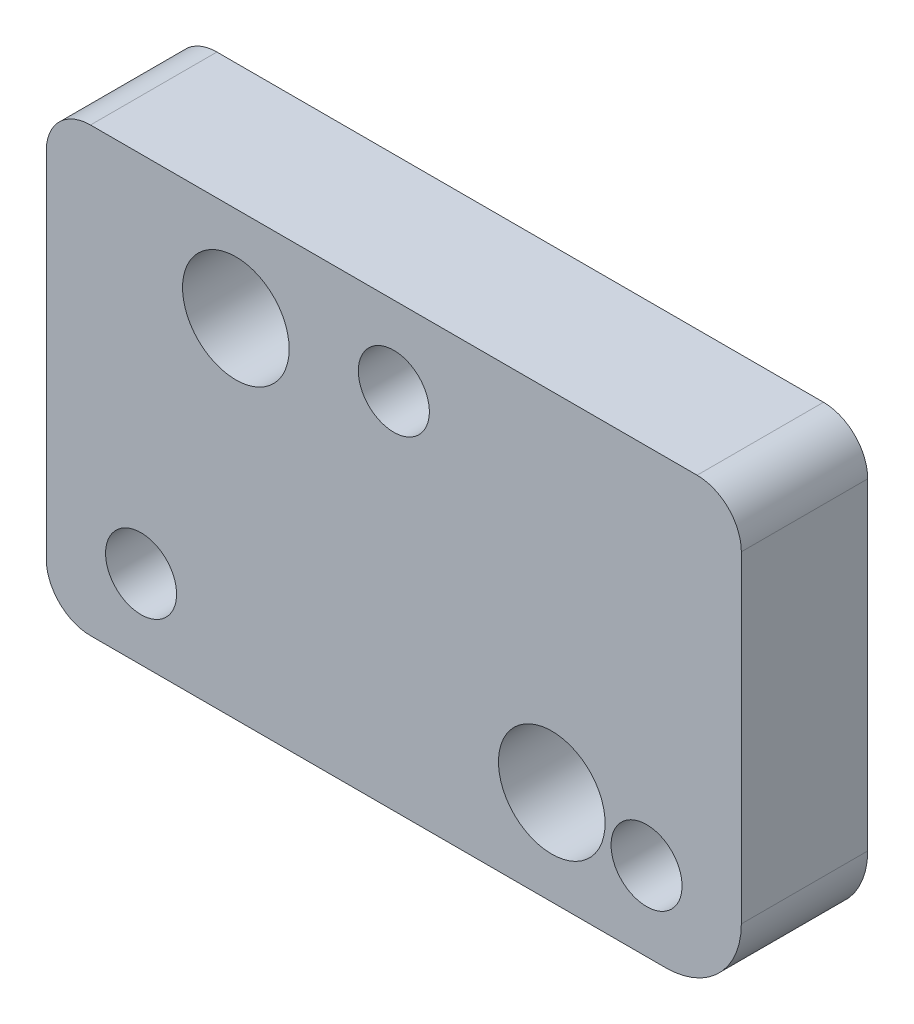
ISO-10303-21;
HEADER;
FILE_DESCRIPTION(('STEP AP214'),'2;1');
FILE_NAME('part.step','',(''),(''),'','','');
FILE_SCHEMA(('AUTOMOTIVE_DESIGN { 1 0 10303 214 1 1 1 1 }'));
ENDSEC;
DATA;
#1=APPLICATION_CONTEXT('core data for automotive mechanical design processes');
#2=APPLICATION_PROTOCOL_DEFINITION('international standard','automotive_design',2000,#1);
#3=PRODUCT_CONTEXT('',#1,'mechanical');
#4=PRODUCT('Part','Part','',(#3));
#5=PRODUCT_RELATED_PRODUCT_CATEGORY('part','',(#4));
#6=PRODUCT_DEFINITION_FORMATION('','',#4);
#7=PRODUCT_DEFINITION_CONTEXT('part definition',#1,'design');
#8=PRODUCT_DEFINITION('design','',#6,#7);
#9=PRODUCT_DEFINITION_SHAPE('','',#8);
#10=(LENGTH_UNIT() NAMED_UNIT(*) SI_UNIT(.MILLI.,.METRE.));
#11=(NAMED_UNIT(*) PLANE_ANGLE_UNIT() SI_UNIT($,.RADIAN.));
#12=(NAMED_UNIT(*) SI_UNIT($,.STERADIAN.) SOLID_ANGLE_UNIT());
#13=UNCERTAINTY_MEASURE_WITH_UNIT(LENGTH_MEASURE(1.E-05),#10,'distance_accuracy_value','');
#14=(GEOMETRIC_REPRESENTATION_CONTEXT(3) GLOBAL_UNCERTAINTY_ASSIGNED_CONTEXT((#13)) GLOBAL_UNIT_ASSIGNED_CONTEXT((#10,
#11,#12)) REPRESENTATION_CONTEXT('',''));
#15=CARTESIAN_POINT('',(0.,0.,0.));
#16=DIRECTION('',(0.,0.,1.));
#17=DIRECTION('',(1.,0.,0.));
#18=AXIS2_PLACEMENT_3D('',#15,#16,#17);
#19=CARTESIAN_POINT('',(-840.26329577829,-45.5554062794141,84.6582));
#20=DIRECTION('',(0.,0.,-1.));
#21=DIRECTION('',(-1.,0.,0.));
#22=AXIS2_PLACEMENT_3D('',#19,#20,#21);
#23=CYLINDRICAL_SURFACE('',#22,7.61999999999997);
#24=CARTESIAN_POINT('',(-840.26329577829,-45.5554062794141,71.9582));
#25=DIRECTION('',(0.,0.,-1.));
#26=DIRECTION('',(-1.,0.,0.));
#27=AXIS2_PLACEMENT_3D('',#24,#25,#26);
#28=CIRCLE('',#27,7.61999999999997);
#29=CARTESIAN_POINT('',(-832.64329577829,-45.5554062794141,71.9582));
#30=VERTEX_POINT('',#29);
#31=CARTESIAN_POINT('',(-840.26329577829,-53.1754062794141,71.9582));
#32=VERTEX_POINT('',#31);
#33=EDGE_CURVE('E153',#30,#32,#28,.T.);
#34=ORIENTED_EDGE('',*,*,#33,.F.);
#35=DIRECTION('',(0.,0.,-1.));
#36=VECTOR('',#35,1.);
#37=CARTESIAN_POINT('',(-832.64329577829,-45.5554062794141,84.6582));
#38=LINE('',#37,#36);
#39=CARTESIAN_POINT('',(-832.64329577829,-45.5554062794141,84.6582));
#40=VERTEX_POINT('',#39);
#41=EDGE_CURVE('E11',#40,#30,#38,.T.);
#42=ORIENTED_EDGE('',*,*,#41,.F.);
#43=CARTESIAN_POINT('',(-840.26329577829,-45.5554062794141,84.6582));
#44=DIRECTION('',(0.,0.,-1.));
#45=DIRECTION('',(-1.,0.,0.));
#46=AXIS2_PLACEMENT_3D('',#43,#44,#45);
#47=CIRCLE('',#46,7.61999999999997);
#48=CARTESIAN_POINT('',(-840.26329577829,-53.1754062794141,84.6582));
#49=VERTEX_POINT('',#48);
#50=EDGE_CURVE('E182',#40,#49,#47,.T.);
#51=ORIENTED_EDGE('',*,*,#50,.T.);
#52=DIRECTION('',(0.,0.,-1.));
#53=VECTOR('',#52,1.);
#54=CARTESIAN_POINT('',(-840.26329577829,-53.1754062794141,84.6582));
#55=LINE('',#54,#53);
#56=EDGE_CURVE('E52',#49,#32,#55,.T.);
#57=ORIENTED_EDGE('',*,*,#56,.T.);
#58=EDGE_LOOP('',(#34,#42,#51,#57));
#59=FACE_BOUND('',#58,.T.);
#60=ADVANCED_FACE('F49',(#59),#23,.T.);
#61=CARTESIAN_POINT('',(-832.64329577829,-13.1704062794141,84.6582));
#62=DIRECTION('',(1.,0.,0.));
#63=DIRECTION('',(0.,0.,-1.));
#64=AXIS2_PLACEMENT_3D('',#61,#62,#63);
#65=PLANE('',#64);
#66=DIRECTION('',(0.,-1.,0.));
#67=VECTOR('',#66,1.);
#68=CARTESIAN_POINT('',(-832.64329577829,-13.1704062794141,71.9582));
#69=LINE('',#68,#67);
#70=CARTESIAN_POINT('',(-832.64329577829,-13.1704062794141,71.9582));
#71=VERTEX_POINT('',#70);
#72=EDGE_CURVE('E179',#71,#30,#69,.T.);
#73=ORIENTED_EDGE('',*,*,#72,.F.);
#74=DIRECTION('',(0.,0.,-1.));
#75=VECTOR('',#74,1.);
#76=CARTESIAN_POINT('',(-832.64329577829,-13.1704062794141,84.6582));
#77=LINE('',#76,#75);
#78=CARTESIAN_POINT('',(-832.64329577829,-13.1704062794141,84.6582));
#79=VERTEX_POINT('',#78);
#80=EDGE_CURVE('E59',#79,#71,#77,.T.);
#81=ORIENTED_EDGE('',*,*,#80,.F.);
#82=DIRECTION('',(0.,-1.,0.));
#83=VECTOR('',#82,1.);
#84=CARTESIAN_POINT('',(-832.64329577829,-13.1704062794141,84.6582));
#85=LINE('',#84,#83);
#86=EDGE_CURVE('E138',#79,#40,#85,.T.);
#87=ORIENTED_EDGE('',*,*,#86,.T.);
#88=ORIENTED_EDGE('',*,*,#41,.T.);
#89=EDGE_LOOP('',(#73,#81,#87,#88));
#90=FACE_BOUND('',#89,.T.);
#91=ADVANCED_FACE('F202',(#90),#65,.T.);
#92=CARTESIAN_POINT('',(-837.08829577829,-13.1704062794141,84.6582));
#93=DIRECTION('',(0.,0.,-1.));
#94=DIRECTION('',(-1.,0.,0.));
#95=AXIS2_PLACEMENT_3D('',#92,#93,#94);
#96=CYLINDRICAL_SURFACE('',#95,4.44500000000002);
#97=CARTESIAN_POINT('',(-837.08829577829,-13.1704062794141,71.9582));
#98=DIRECTION('',(0.,0.,-1.));
#99=DIRECTION('',(-1.,0.,0.));
#100=AXIS2_PLACEMENT_3D('',#97,#98,#99);
#101=CIRCLE('',#100,4.44500000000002);
#102=CARTESIAN_POINT('',(-837.08829577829,-8.72540627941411,71.9582));
#103=VERTEX_POINT('',#102);
#104=EDGE_CURVE('E124',#103,#71,#101,.T.);
#105=ORIENTED_EDGE('',*,*,#104,.F.);
#106=DIRECTION('',(0.,0.,-1.));
#107=VECTOR('',#106,1.);
#108=CARTESIAN_POINT('',(-837.08829577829,-8.72540627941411,84.6582));
#109=LINE('',#108,#107);
#110=CARTESIAN_POINT('',(-837.08829577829,-8.72540627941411,84.6582));
#111=VERTEX_POINT('',#110);
#112=EDGE_CURVE('E119',#111,#103,#109,.T.);
#113=ORIENTED_EDGE('',*,*,#112,.F.);
#114=CARTESIAN_POINT('',(-837.08829577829,-13.1704062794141,84.6582));
#115=DIRECTION('',(0.,0.,-1.));
#116=DIRECTION('',(-1.,0.,0.));
#117=AXIS2_PLACEMENT_3D('',#114,#115,#116);
#118=CIRCLE('',#117,4.44500000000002);
#119=EDGE_CURVE('E122',#111,#79,#118,.T.);
#120=ORIENTED_EDGE('',*,*,#119,.T.);
#121=ORIENTED_EDGE('',*,*,#80,.T.);
#122=EDGE_LOOP('',(#105,#113,#120,#121));
#123=FACE_BOUND('',#122,.T.);
#124=ADVANCED_FACE('F121',(#123),#96,.T.);
#125=CARTESIAN_POINT('',(-898.04829577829,-8.72540627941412,84.6582));
#126=DIRECTION('',(0.,1.,0.));
#127=DIRECTION('',(0.,0.,1.));
#128=AXIS2_PLACEMENT_3D('',#125,#126,#127);
#129=PLANE('',#128);
#130=DIRECTION('',(1.,0.,0.));
#131=VECTOR('',#130,1.);
#132=CARTESIAN_POINT('',(-898.04829577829,-8.72540627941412,71.9582));
#133=LINE('',#132,#131);
#134=CARTESIAN_POINT('',(-898.04829577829,-8.72540627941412,71.9582));
#135=VERTEX_POINT('',#134);
#136=EDGE_CURVE('E174',#135,#103,#133,.T.);
#137=ORIENTED_EDGE('',*,*,#136,.F.);
#138=DIRECTION('',(0.,0.,-1.));
#139=VECTOR('',#138,1.);
#140=CARTESIAN_POINT('',(-898.04829577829,-8.72540627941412,84.6582));
#141=LINE('',#140,#139);
#142=CARTESIAN_POINT('',(-898.04829577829,-8.72540627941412,84.6582));
#143=VERTEX_POINT('',#142);
#144=EDGE_CURVE('E130',#143,#135,#141,.T.);
#145=ORIENTED_EDGE('',*,*,#144,.F.);
#146=DIRECTION('',(1.,0.,0.));
#147=VECTOR('',#146,1.);
#148=CARTESIAN_POINT('',(-898.04829577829,-8.72540627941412,84.6582));
#149=LINE('',#148,#147);
#150=EDGE_CURVE('E136',#143,#111,#149,.T.);
#151=ORIENTED_EDGE('',*,*,#150,.T.);
#152=ORIENTED_EDGE('',*,*,#112,.T.);
#153=EDGE_LOOP('',(#137,#145,#151,#152));
#154=FACE_BOUND('',#153,.T.);
#155=ADVANCED_FACE('F141',(#154),#129,.T.);
#156=CARTESIAN_POINT('',(-898.04829577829,-13.1704062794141,84.6582));
#157=DIRECTION('',(0.,0.,-1.));
#158=DIRECTION('',(-1.,0.,0.));
#159=AXIS2_PLACEMENT_3D('',#156,#157,#158);
#160=CYLINDRICAL_SURFACE('',#159,4.44500000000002);
#161=CARTESIAN_POINT('',(-898.04829577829,-13.1704062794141,71.9582));
#162=DIRECTION('',(0.,0.,-1.));
#163=DIRECTION('',(-1.,0.,0.));
#164=AXIS2_PLACEMENT_3D('',#161,#162,#163);
#165=CIRCLE('',#164,4.44500000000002);
#166=CARTESIAN_POINT('',(-902.49329577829,-13.1704062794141,71.9582));
#167=VERTEX_POINT('',#166);
#168=EDGE_CURVE('E170',#167,#135,#165,.T.);
#169=ORIENTED_EDGE('',*,*,#168,.F.);
#170=DIRECTION('',(0.,0.,-1.));
#171=VECTOR('',#170,1.);
#172=CARTESIAN_POINT('',(-902.49329577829,-13.1704062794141,84.6582));
#173=LINE('',#172,#171);
#174=CARTESIAN_POINT('',(-902.49329577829,-13.1704062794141,84.6582));
#175=VERTEX_POINT('',#174);
#176=EDGE_CURVE('E188',#175,#167,#173,.T.);
#177=ORIENTED_EDGE('',*,*,#176,.F.);
#178=CARTESIAN_POINT('',(-898.04829577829,-13.1704062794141,84.6582));
#179=DIRECTION('',(0.,0.,-1.));
#180=DIRECTION('',(-1.,0.,0.));
#181=AXIS2_PLACEMENT_3D('',#178,#179,#180);
#182=CIRCLE('',#181,4.44500000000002);
#183=EDGE_CURVE('E143',#175,#143,#182,.T.);
#184=ORIENTED_EDGE('',*,*,#183,.T.);
#185=ORIENTED_EDGE('',*,*,#144,.T.);
#186=EDGE_LOOP('',(#169,#177,#184,#185));
#187=FACE_BOUND('',#186,.T.);
#188=ADVANCED_FACE('F215',(#187),#160,.T.);
#189=CARTESIAN_POINT('',(-902.49329577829,-48.7304062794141,84.6582));
#190=DIRECTION('',(-1.,0.,0.));
#191=DIRECTION('',(0.,0.,1.));
#192=AXIS2_PLACEMENT_3D('',#189,#190,#191);
#193=PLANE('',#192);
#194=DIRECTION('',(0.,1.,0.));
#195=VECTOR('',#194,1.);
#196=CARTESIAN_POINT('',(-902.49329577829,-48.7304062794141,71.9582));
#197=LINE('',#196,#195);
#198=CARTESIAN_POINT('',(-902.49329577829,-48.7304062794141,71.9582));
#199=VERTEX_POINT('',#198);
#200=EDGE_CURVE('E166',#199,#167,#197,.T.);
#201=ORIENTED_EDGE('',*,*,#200,.F.);
#202=DIRECTION('',(0.,0.,-1.));
#203=VECTOR('',#202,1.);
#204=CARTESIAN_POINT('',(-902.49329577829,-48.7304062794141,84.6582));
#205=LINE('',#204,#203);
#206=CARTESIAN_POINT('',(-902.49329577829,-48.7304062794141,84.6582));
#207=VERTEX_POINT('',#206);
#208=EDGE_CURVE('E191',#207,#199,#205,.T.);
#209=ORIENTED_EDGE('',*,*,#208,.F.);
#210=DIRECTION('',(0.,1.,0.));
#211=VECTOR('',#210,1.);
#212=CARTESIAN_POINT('',(-902.49329577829,-48.7304062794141,84.6582));
#213=LINE('',#212,#211);
#214=EDGE_CURVE('E147',#207,#175,#213,.T.);
#215=ORIENTED_EDGE('',*,*,#214,.T.);
#216=ORIENTED_EDGE('',*,*,#176,.T.);
#217=EDGE_LOOP('',(#201,#209,#215,#216));
#218=FACE_BOUND('',#217,.T.);
#219=ADVANCED_FACE('F218',(#218),#193,.T.);
#220=CARTESIAN_POINT('',(-898.04829577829,-48.7304062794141,84.6582));
#221=DIRECTION('',(0.,0.,-1.));
#222=DIRECTION('',(-1.,0.,0.));
#223=AXIS2_PLACEMENT_3D('',#220,#221,#222);
#224=CYLINDRICAL_SURFACE('',#223,4.44500000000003);
#225=CARTESIAN_POINT('',(-898.04829577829,-48.7304062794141,71.9582));
#226=DIRECTION('',(0.,0.,-1.));
#227=DIRECTION('',(-1.,0.,0.));
#228=AXIS2_PLACEMENT_3D('',#225,#226,#227);
#229=CIRCLE('',#228,4.44500000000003);
#230=CARTESIAN_POINT('',(-898.04829577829,-53.1754062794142,71.9582));
#231=VERTEX_POINT('',#230);
#232=EDGE_CURVE('E162',#231,#199,#229,.T.);
#233=ORIENTED_EDGE('',*,*,#232,.F.);
#234=DIRECTION('',(0.,0.,-1.));
#235=VECTOR('',#234,1.);
#236=CARTESIAN_POINT('',(-898.04829577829,-53.1754062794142,84.6582));
#237=LINE('',#236,#235);
#238=CARTESIAN_POINT('',(-898.04829577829,-53.1754062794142,84.6582));
#239=VERTEX_POINT('',#238);
#240=EDGE_CURVE('E193',#239,#231,#237,.T.);
#241=ORIENTED_EDGE('',*,*,#240,.F.);
#242=CARTESIAN_POINT('',(-898.04829577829,-48.7304062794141,84.6582));
#243=DIRECTION('',(0.,0.,-1.));
#244=DIRECTION('',(-1.,0.,0.));
#245=AXIS2_PLACEMENT_3D('',#242,#243,#244);
#246=CIRCLE('',#245,4.44500000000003);
#247=EDGE_CURVE('E342',#239,#207,#246,.T.);
#248=ORIENTED_EDGE('',*,*,#247,.T.);
#249=ORIENTED_EDGE('',*,*,#208,.T.);
#250=EDGE_LOOP('',(#233,#241,#248,#249));
#251=FACE_BOUND('',#250,.T.);
#252=ADVANCED_FACE('F222',(#251),#224,.T.);
#253=CARTESIAN_POINT('',(-840.26329577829,-53.1754062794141,84.6582));
#254=DIRECTION('',(0.,-1.,0.));
#255=DIRECTION('',(1.,0.,0.));
#256=AXIS2_PLACEMENT_3D('',#253,#254,#255);
#257=PLANE('',#256);
#258=DIRECTION('',(-1.,0.,0.));
#259=VECTOR('',#258,1.);
#260=CARTESIAN_POINT('',(-840.26329577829,-53.1754062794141,71.9582));
#261=LINE('',#260,#259);
#262=EDGE_CURVE('E157',#32,#231,#261,.T.);
#263=ORIENTED_EDGE('',*,*,#262,.F.);
#264=ORIENTED_EDGE('',*,*,#56,.F.);
#265=DIRECTION('',(-1.,0.,0.));
#266=VECTOR('',#265,1.);
#267=CARTESIAN_POINT('',(-840.26329577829,-53.1754062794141,84.6582));
#268=LINE('',#267,#266);
#269=EDGE_CURVE('E339',#49,#239,#268,.T.);
#270=ORIENTED_EDGE('',*,*,#269,.T.);
#271=ORIENTED_EDGE('',*,*,#240,.T.);
#272=EDGE_LOOP('',(#263,#264,#270,#271));
#273=FACE_BOUND('',#272,.T.);
#274=ADVANCED_FACE('F199',(#273),#257,.T.);
#275=CARTESIAN_POINT('',(-840.26329577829,-45.5554062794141,84.6582));
#276=DIRECTION('',(0.,0.,-1.));
#277=DIRECTION('',(-1.,0.,0.));
#278=AXIS2_PLACEMENT_3D('',#275,#276,#277);
#279=PLANE('',#278);
#280=CARTESIAN_POINT('',(-851.69329577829,-43.6504062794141,84.6582));
#281=DIRECTION('',(0.,0.,1.));
#282=DIRECTION('',(1.,0.,0.));
#283=AXIS2_PLACEMENT_3D('',#280,#281,#282);
#284=CIRCLE('',#283,5.35940000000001);
#285=CARTESIAN_POINT('',(-846.33389577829,-43.6504062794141,84.6582));
#286=VERTEX_POINT('',#285);
#287=EDGE_CURVE('E291',#286,#286,#284,.T.);
#288=ORIENTED_EDGE('',*,*,#287,.F.);
#289=EDGE_LOOP('',(#288));
#290=FACE_BOUND('',#289,.T.);
#291=CARTESIAN_POINT('',(-883.44329577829,-18.2504062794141,84.6582));
#292=DIRECTION('',(0.,0.,1.));
#293=DIRECTION('',(1.,0.,0.));
#294=AXIS2_PLACEMENT_3D('',#291,#292,#293);
#295=CIRCLE('',#294,5.35940000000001);
#296=CARTESIAN_POINT('',(-878.08389577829,-18.2504062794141,84.6582));
#297=VERTEX_POINT('',#296);
#298=EDGE_CURVE('E310',#297,#297,#295,.T.);
#299=ORIENTED_EDGE('',*,*,#298,.F.);
#300=EDGE_LOOP('',(#299));
#301=FACE_BOUND('',#300,.T.);
#302=CARTESIAN_POINT('',(-842.16829577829,-45.2379062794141,84.6582));
#303=DIRECTION('',(0.,0.,-1.));
#304=DIRECTION('',(-1.,0.,0.));
#305=AXIS2_PLACEMENT_3D('',#302,#303,#304);
#306=CIRCLE('',#305,3.56869999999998);
#307=CARTESIAN_POINT('',(-845.73699577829,-45.2379062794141,84.6582));
#308=VERTEX_POINT('',#307);
#309=EDGE_CURVE('E314',#308,#308,#306,.T.);
#310=ORIENTED_EDGE('',*,*,#309,.T.);
#311=EDGE_LOOP('',(#310));
#312=FACE_BOUND('',#311,.T.);
#313=CARTESIAN_POINT('',(-892.96829577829,-45.2379062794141,84.6582));
#314=DIRECTION('',(0.,0.,-1.));
#315=DIRECTION('',(-1.,0.,0.));
#316=AXIS2_PLACEMENT_3D('',#313,#314,#315);
#317=CIRCLE('',#316,3.56869999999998);
#318=CARTESIAN_POINT('',(-896.53699577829,-45.2379062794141,84.6582));
#319=VERTEX_POINT('',#318);
#320=EDGE_CURVE('E322',#319,#319,#317,.T.);
#321=ORIENTED_EDGE('',*,*,#320,.T.);
#322=EDGE_LOOP('',(#321));
#323=FACE_BOUND('',#322,.T.);
#324=CARTESIAN_POINT('',(-867.56829577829,-16.6629062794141,84.6582));
#325=DIRECTION('',(0.,0.,-1.));
#326=DIRECTION('',(-1.,0.,0.));
#327=AXIS2_PLACEMENT_3D('',#324,#325,#326);
#328=CIRCLE('',#327,3.56869999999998);
#329=CARTESIAN_POINT('',(-871.13699577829,-16.6629062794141,84.6582));
#330=VERTEX_POINT('',#329);
#331=EDGE_CURVE('E330',#330,#330,#328,.T.);
#332=ORIENTED_EDGE('',*,*,#331,.T.);
#333=EDGE_LOOP('',(#332));
#334=FACE_BOUND('',#333,.T.);
#335=ORIENTED_EDGE('',*,*,#50,.F.);
#336=ORIENTED_EDGE('',*,*,#86,.F.);
#337=ORIENTED_EDGE('',*,*,#119,.F.);
#338=ORIENTED_EDGE('',*,*,#150,.F.);
#339=ORIENTED_EDGE('',*,*,#183,.F.);
#340=ORIENTED_EDGE('',*,*,#214,.F.);
#341=ORIENTED_EDGE('',*,*,#247,.F.);
#342=ORIENTED_EDGE('',*,*,#269,.F.);
#343=EDGE_LOOP('',(#335,#336,#337,#338,#339,#340,#341,#342));
#344=FACE_BOUND('',#343,.T.);
#345=ADVANCED_FACE('F134',(#290,#301,#312,#323,#334,#344),#279,.F.);
#346=CARTESIAN_POINT('',(-840.26329577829,-45.5554062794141,71.9582));
#347=DIRECTION('',(0.,0.,-1.));
#348=DIRECTION('',(-1.,0.,0.));
#349=AXIS2_PLACEMENT_3D('',#346,#347,#348);
#350=PLANE('',#349);
#351=CARTESIAN_POINT('',(-851.69329577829,-43.6504062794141,71.9582));
#352=DIRECTION('',(0.,0.,1.));
#353=DIRECTION('',(1.,0.,0.));
#354=AXIS2_PLACEMENT_3D('',#351,#352,#353);
#355=CIRCLE('',#354,3.56869999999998);
#356=CARTESIAN_POINT('',(-848.12459577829,-43.6504062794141,71.9582));
#357=VERTEX_POINT('',#356);
#358=EDGE_CURVE('E280',#357,#357,#355,.T.);
#359=ORIENTED_EDGE('',*,*,#358,.T.);
#360=EDGE_LOOP('',(#359));
#361=FACE_BOUND('',#360,.T.);
#362=CARTESIAN_POINT('',(-883.44329577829,-18.2504062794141,71.9582));
#363=DIRECTION('',(0.,0.,1.));
#364=DIRECTION('',(1.,0.,0.));
#365=AXIS2_PLACEMENT_3D('',#362,#363,#364);
#366=CIRCLE('',#365,3.56869999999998);
#367=CARTESIAN_POINT('',(-879.87459577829,-18.2504062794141,71.9582));
#368=VERTEX_POINT('',#367);
#369=EDGE_CURVE('E298',#368,#368,#366,.T.);
#370=ORIENTED_EDGE('',*,*,#369,.T.);
#371=EDGE_LOOP('',(#370));
#372=FACE_BOUND('',#371,.T.);
#373=CARTESIAN_POINT('',(-842.16829577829,-45.2379062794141,71.9582));
#374=DIRECTION('',(0.,0.,-1.));
#375=DIRECTION('',(-1.,0.,0.));
#376=AXIS2_PLACEMENT_3D('',#373,#374,#375);
#377=CIRCLE('',#376,3.56869999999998);
#378=CARTESIAN_POINT('',(-845.73699577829,-45.2379062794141,71.9582));
#379=VERTEX_POINT('',#378);
#380=EDGE_CURVE('E318',#379,#379,#377,.T.);
#381=ORIENTED_EDGE('',*,*,#380,.F.);
#382=EDGE_LOOP('',(#381));
#383=FACE_BOUND('',#382,.T.);
#384=CARTESIAN_POINT('',(-892.96829577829,-45.2379062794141,71.9582));
#385=DIRECTION('',(0.,0.,-1.));
#386=DIRECTION('',(-1.,0.,0.));
#387=AXIS2_PLACEMENT_3D('',#384,#385,#386);
#388=CIRCLE('',#387,3.56869999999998);
#389=CARTESIAN_POINT('',(-896.53699577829,-45.2379062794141,71.9582));
#390=VERTEX_POINT('',#389);
#391=EDGE_CURVE('E326',#390,#390,#388,.T.);
#392=ORIENTED_EDGE('',*,*,#391,.F.);
#393=EDGE_LOOP('',(#392));
#394=FACE_BOUND('',#393,.T.);
#395=CARTESIAN_POINT('',(-867.56829577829,-16.6629062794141,71.9582));
#396=DIRECTION('',(0.,0.,-1.));
#397=DIRECTION('',(-1.,0.,0.));
#398=AXIS2_PLACEMENT_3D('',#395,#396,#397);
#399=CIRCLE('',#398,3.56869999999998);
#400=CARTESIAN_POINT('',(-871.13699577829,-16.6629062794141,71.9582));
#401=VERTEX_POINT('',#400);
#402=EDGE_CURVE('E158',#401,#401,#399,.T.);
#403=ORIENTED_EDGE('',*,*,#402,.F.);
#404=EDGE_LOOP('',(#403));
#405=FACE_BOUND('',#404,.T.);
#406=ORIENTED_EDGE('',*,*,#33,.T.);
#407=ORIENTED_EDGE('',*,*,#262,.T.);
#408=ORIENTED_EDGE('',*,*,#232,.T.);
#409=ORIENTED_EDGE('',*,*,#200,.T.);
#410=ORIENTED_EDGE('',*,*,#168,.T.);
#411=ORIENTED_EDGE('',*,*,#136,.T.);
#412=ORIENTED_EDGE('',*,*,#104,.T.);
#413=ORIENTED_EDGE('',*,*,#72,.T.);
#414=EDGE_LOOP('',(#406,#407,#408,#409,#410,#411,#412,#413));
#415=FACE_BOUND('',#414,.T.);
#416=ADVANCED_FACE('F201',(#361,#372,#383,#394,#405,#415),#350,.T.);
#417=CARTESIAN_POINT('',(-867.56829577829,-16.6629062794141,71.9582));
#418=DIRECTION('',(0.,0.,-1.));
#419=DIRECTION('',(-1.,0.,0.));
#420=AXIS2_PLACEMENT_3D('',#417,#418,#419);
#421=CYLINDRICAL_SURFACE('',#420,3.56869999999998);
#422=ORIENTED_EDGE('',*,*,#331,.F.);
#423=EDGE_LOOP('',(#422));
#424=FACE_BOUND('',#423,.T.);
#425=ORIENTED_EDGE('',*,*,#402,.T.);
#426=EDGE_LOOP('',(#425));
#427=FACE_BOUND('',#426,.T.);
#428=ADVANCED_FACE('F236',(#424,#427),#421,.F.);
#429=CARTESIAN_POINT('',(-892.96829577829,-45.2379062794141,71.9582));
#430=DIRECTION('',(0.,0.,-1.));
#431=DIRECTION('',(-1.,0.,0.));
#432=AXIS2_PLACEMENT_3D('',#429,#430,#431);
#433=CYLINDRICAL_SURFACE('',#432,3.56869999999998);
#434=ORIENTED_EDGE('',*,*,#320,.F.);
#435=EDGE_LOOP('',(#434));
#436=FACE_BOUND('',#435,.T.);
#437=ORIENTED_EDGE('',*,*,#391,.T.);
#438=EDGE_LOOP('',(#437));
#439=FACE_BOUND('',#438,.T.);
#440=ADVANCED_FACE('F243',(#436,#439),#433,.F.);
#441=CARTESIAN_POINT('',(-842.16829577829,-45.2379062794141,71.9582));
#442=DIRECTION('',(0.,0.,-1.));
#443=DIRECTION('',(-1.,0.,0.));
#444=AXIS2_PLACEMENT_3D('',#441,#442,#443);
#445=CYLINDRICAL_SURFACE('',#444,3.56869999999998);
#446=ORIENTED_EDGE('',*,*,#309,.F.);
#447=EDGE_LOOP('',(#446));
#448=FACE_BOUND('',#447,.T.);
#449=ORIENTED_EDGE('',*,*,#380,.T.);
#450=EDGE_LOOP('',(#449));
#451=FACE_BOUND('',#450,.T.);
#452=ADVANCED_FACE('F247',(#448,#451),#445,.F.);
#453=CARTESIAN_POINT('',(-883.44329577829,-18.2504062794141,84.6582));
#454=DIRECTION('',(0.,0.,1.));
#455=DIRECTION('',(1.,0.,0.));
#456=AXIS2_PLACEMENT_3D('',#453,#454,#455);
#457=CYLINDRICAL_SURFACE('',#456,5.35940000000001);
#458=CARTESIAN_POINT('',(-883.44329577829,-18.2504062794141,76.7842));
#459=DIRECTION('',(0.,0.,1.));
#460=DIRECTION('',(1.,0.,0.));
#461=AXIS2_PLACEMENT_3D('',#458,#459,#460);
#462=CIRCLE('',#461,5.35940000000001);
#463=CARTESIAN_POINT('',(-878.08389577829,-18.2504062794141,76.7842));
#464=VERTEX_POINT('',#463);
#465=EDGE_CURVE('E306',#464,#464,#462,.T.);
#466=ORIENTED_EDGE('',*,*,#465,.F.);
#467=EDGE_LOOP('',(#466));
#468=FACE_BOUND('',#467,.T.);
#469=ORIENTED_EDGE('',*,*,#298,.T.);
#470=EDGE_LOOP('',(#469));
#471=FACE_BOUND('',#470,.T.);
#472=ADVANCED_FACE('F251',(#468,#471),#457,.F.);
#473=CARTESIAN_POINT('',(-879.87459577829,-18.2504062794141,76.7842));
#474=DIRECTION('',(0.,0.,-1.));
#475=DIRECTION('',(-1.,0.,0.));
#476=AXIS2_PLACEMENT_3D('',#473,#474,#475);
#477=PLANE('',#476);
#478=CARTESIAN_POINT('',(-883.44329577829,-18.2504062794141,76.7842));
#479=DIRECTION('',(0.,0.,1.));
#480=DIRECTION('',(1.,0.,0.));
#481=AXIS2_PLACEMENT_3D('',#478,#479,#480);
#482=CIRCLE('',#481,3.56869999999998);
#483=CARTESIAN_POINT('',(-879.87459577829,-18.2504062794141,76.7842));
#484=VERTEX_POINT('',#483);
#485=EDGE_CURVE('E302',#484,#484,#482,.T.);
#486=ORIENTED_EDGE('',*,*,#485,.F.);
#487=EDGE_LOOP('',(#486));
#488=FACE_BOUND('',#487,.T.);
#489=ORIENTED_EDGE('',*,*,#465,.T.);
#490=EDGE_LOOP('',(#489));
#491=FACE_BOUND('',#490,.T.);
#492=ADVANCED_FACE('F255',(#488,#491),#477,.F.);
#493=CARTESIAN_POINT('',(-883.44329577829,-18.2504062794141,84.6582));
#494=DIRECTION('',(0.,0.,1.));
#495=DIRECTION('',(1.,0.,0.));
#496=AXIS2_PLACEMENT_3D('',#493,#494,#495);
#497=CYLINDRICAL_SURFACE('',#496,3.56869999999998);
#498=ORIENTED_EDGE('',*,*,#369,.F.);
#499=EDGE_LOOP('',(#498));
#500=FACE_BOUND('',#499,.T.);
#501=ORIENTED_EDGE('',*,*,#485,.T.);
#502=EDGE_LOOP('',(#501));
#503=FACE_BOUND('',#502,.T.);
#504=ADVANCED_FACE('F259',(#500,#503),#497,.F.);
#505=CARTESIAN_POINT('',(-851.69329577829,-43.6504062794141,84.6582));
#506=DIRECTION('',(0.,0.,1.));
#507=DIRECTION('',(1.,0.,0.));
#508=AXIS2_PLACEMENT_3D('',#505,#506,#507);
#509=CYLINDRICAL_SURFACE('',#508,5.35940000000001);
#510=CARTESIAN_POINT('',(-851.69329577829,-43.6504062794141,76.7842));
#511=DIRECTION('',(0.,0.,1.));
#512=DIRECTION('',(1.,0.,0.));
#513=AXIS2_PLACEMENT_3D('',#510,#511,#512);
#514=CIRCLE('',#513,5.35940000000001);
#515=CARTESIAN_POINT('',(-846.33389577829,-43.6504062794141,76.7842));
#516=VERTEX_POINT('',#515);
#517=EDGE_CURVE('E285',#516,#516,#514,.T.);
#518=ORIENTED_EDGE('',*,*,#517,.F.);
#519=EDGE_LOOP('',(#518));
#520=FACE_BOUND('',#519,.T.);
#521=ORIENTED_EDGE('',*,*,#287,.T.);
#522=EDGE_LOOP('',(#521));
#523=FACE_BOUND('',#522,.T.);
#524=ADVANCED_FACE('F263',(#520,#523),#509,.F.);
#525=CARTESIAN_POINT('',(-848.12459577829,-43.6504062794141,76.7842));
#526=DIRECTION('',(0.,0.,-1.));
#527=DIRECTION('',(-1.,0.,0.));
#528=AXIS2_PLACEMENT_3D('',#525,#526,#527);
#529=PLANE('',#528);
#530=CARTESIAN_POINT('',(-851.69329577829,-43.6504062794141,76.7842));
#531=DIRECTION('',(0.,0.,1.));
#532=DIRECTION('',(1.,0.,0.));
#533=AXIS2_PLACEMENT_3D('',#530,#531,#532);
#534=CIRCLE('',#533,3.56869999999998);
#535=CARTESIAN_POINT('',(-848.12459577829,-43.6504062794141,76.7842));
#536=VERTEX_POINT('',#535);
#537=EDGE_CURVE('E283',#536,#536,#534,.T.);
#538=ORIENTED_EDGE('',*,*,#537,.F.);
#539=EDGE_LOOP('',(#538));
#540=FACE_BOUND('',#539,.T.);
#541=ORIENTED_EDGE('',*,*,#517,.T.);
#542=EDGE_LOOP('',(#541));
#543=FACE_BOUND('',#542,.T.);
#544=ADVANCED_FACE('F267',(#540,#543),#529,.F.);
#545=CARTESIAN_POINT('',(-851.69329577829,-43.6504062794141,84.6582));
#546=DIRECTION('',(0.,0.,1.));
#547=DIRECTION('',(1.,0.,0.));
#548=AXIS2_PLACEMENT_3D('',#545,#546,#547);
#549=CYLINDRICAL_SURFACE('',#548,3.56869999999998);
#550=ORIENTED_EDGE('',*,*,#358,.F.);
#551=EDGE_LOOP('',(#550));
#552=FACE_BOUND('',#551,.T.);
#553=ORIENTED_EDGE('',*,*,#537,.T.);
#554=EDGE_LOOP('',(#553));
#555=FACE_BOUND('',#554,.T.);
#556=ADVANCED_FACE('F271',(#552,#555),#549,.F.);
#557=CLOSED_SHELL('',(#60,#91,#124,#155,#188,#219,#252,#274,#345,#416,#428,#440,#452,#472,#492,
#504,#524,#544,#556));
#558=MANIFOLD_SOLID_BREP('B2',#557);
#559=ADVANCED_BREP_SHAPE_REPRESENTATION('',(#18,#558),#14);
#560=SHAPE_DEFINITION_REPRESENTATION(#9,#559);
ENDSEC;
END-ISO-10303-21;
